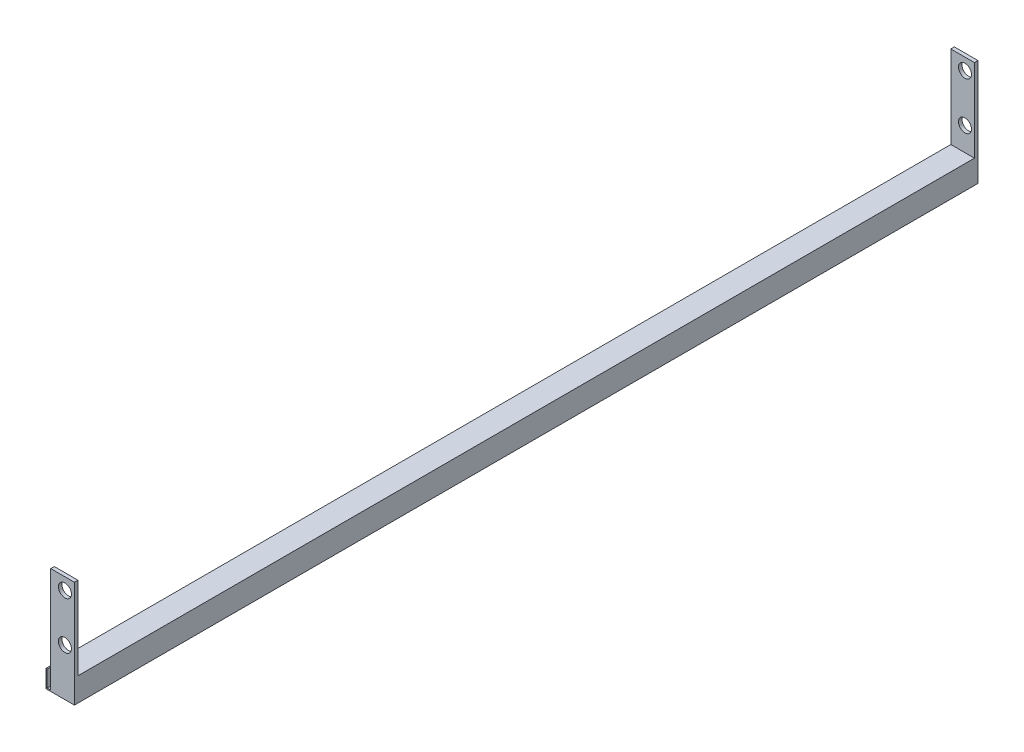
from build123d import *

# Parameters (mm, degrees)
ESQUISSE1_W      = 20
ESQUISSE1_H      = 20
ESQUISSE1_W_2    = 18
ESQUISSE1_H_2    = 18
EXTRUSION1_DEPTH = 758
ESQUISSE2_W      = 20
ESQUISSE2_H      = 90
ESQUISSE2_R      = 5.5
EXTRUSION2_DEPTH = 3
EXTRUSION3_START = 3
ESQUISSE4_W      = 20
ESQUISSE4_H      = 90
ESQUISSE4_R      = 5.5
EXTRUSION3_DEPTH = 3
EXTRUSION4_DEPTH = 764


with BuildPart() as part:
    # Esquisse1 → Extrusion1 (new body)
    with BuildSketch(Plane.XY):
        with Locations((10, 10)):
            Rectangle(ESQUISSE1_W, ESQUISSE1_H)
        with Locations((10, 10)):
            Rectangle(ESQUISSE1_W_2, ESQUISSE1_H_2, mode=Mode.SUBTRACT)
    extrude(amount=EXTRUSION1_DEPTH)

    # Esquisse2 → Extrusion2 (add)
    with BuildSketch(Plane.XY.offset(758)):
        with Locations((10, 45)):
            Rectangle(ESQUISSE2_W, ESQUISSE2_H)
        with Locations((12, 80)):
            Circle(ESQUISSE2_R, mode=Mode.SUBTRACT)
        with Locations((12, 40)):
            Circle(ESQUISSE2_R, mode=Mode.SUBTRACT)
    extrude(amount=EXTRUSION2_DEPTH)

    # Esquisse4 → Extrusion3 (add)
    with BuildSketch(Plane(origin=(0, 0, 0), x_dir=(-1, 0, 0), z_dir=(0, 0, -1)).offset(EXTRUSION3_START)):
        with Locations((-10, 45)):
            Rectangle(ESQUISSE4_W, ESQUISSE4_H)
        with Locations(Location((-12, 40, 0), (0, 0, 180))):
            Circle(ESQUISSE4_R, mode=Mode.SUBTRACT)
        with Locations(Location((-12, 80, 0), (0, 0, 180))):
            Circle(ESQUISSE4_R, mode=Mode.SUBTRACT)
    extrude(amount=-EXTRUSION3_DEPTH)

    # Esquisse5 → Extrusion4 (add)
    with BuildSketch(Plane(origin=(0, 0, -3), x_dir=(-1, 0, 0), z_dir=(0, 0, -1))):
        Polygon((0, 0), (4, 0), (4, 15), (3, 15), (3, 1), (0, 1), align=None)
    extrude(amount=-EXTRUSION4_DEPTH)


solid = part.part
